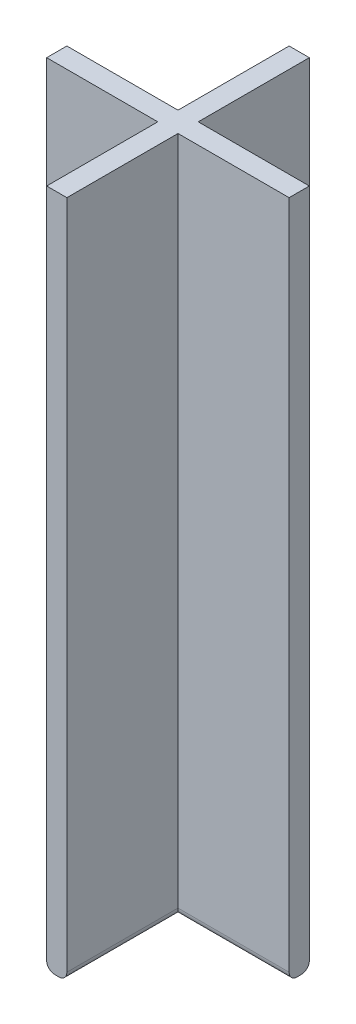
from build123d import *

# Parameters (mm, degrees)
SKETCH2_W           = 15
SKETCH2_H           = 2.5
BOSS_EXTRUDE1_DEPTH = 84
CIRPATTERN1_COUNT   = 4
FILLET1_R           = 1


with BuildPart() as part:
    # Sketch2 → Boss-Extrude1 (new body)
    with BuildSketch(Plane(origin=(0, 0, 0), x_dir=(1, 0, 0), z_dir=(0, 1, 0))):
        with Locations((-7.5, 0)):
            Rectangle(SKETCH2_W, SKETCH2_H)
    boss_extrude1 = extrude(amount=BOSS_EXTRUDE1_DEPTH)

    # CirPattern1: Boss-Extrude1 ×4 about axis
    cirpattern1_axis = Axis((0, 0, 0), (0, 1, 0))
    for i in range(1, CIRPATTERN1_COUNT):
        add(boss_extrude1.rotate(cirpattern1_axis, i * 360 / CIRPATTERN1_COUNT))

    # Fillet1
    fillet1_edges = [part.edges().sort_by_distance(p)[0] for p in [
        (-8.125, 0, -1.25),
        (-1.25, 0, 8.125),
        (-1.25, 0, -8.125),
        (1.25, 0, -8.125),
        (8.125, 0, -1.25),
        (8.125, 0, 1.25),
        (1.25, 0, 8.125),
        (-8.125, 0, 1.25),
    ]]
    fillet(fillet1_edges, radius=FILLET1_R)


solid = part.part
